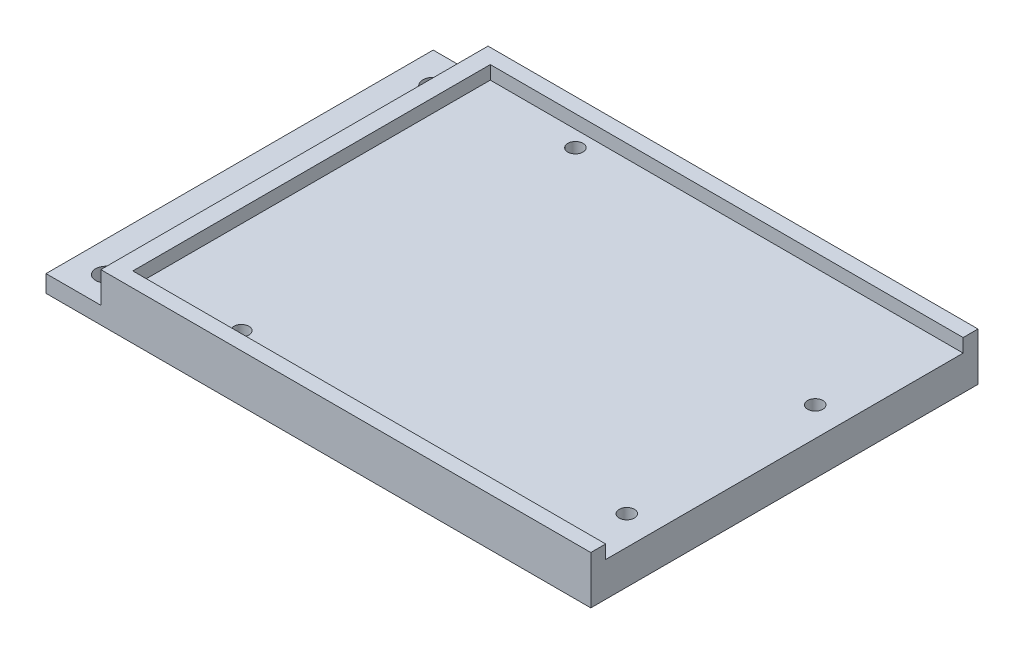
ISO-10303-21;
HEADER;
FILE_DESCRIPTION(('STEP AP214'),'2;1');
FILE_NAME('part.step','',(''),(''),'','','');
FILE_SCHEMA(('AUTOMOTIVE_DESIGN { 1 0 10303 214 1 1 1 1 }'));
ENDSEC;
DATA;
#1=APPLICATION_CONTEXT('core data for automotive mechanical design processes');
#2=APPLICATION_PROTOCOL_DEFINITION('international standard','automotive_design',2000,#1);
#3=PRODUCT_CONTEXT('',#1,'mechanical');
#4=PRODUCT('Part','Part','',(#3));
#5=PRODUCT_RELATED_PRODUCT_CATEGORY('part','',(#4));
#6=PRODUCT_DEFINITION_FORMATION('','',#4);
#7=PRODUCT_DEFINITION_CONTEXT('part definition',#1,'design');
#8=PRODUCT_DEFINITION('design','',#6,#7);
#9=PRODUCT_DEFINITION_SHAPE('','',#8);
#10=(LENGTH_UNIT() NAMED_UNIT(*) SI_UNIT(.MILLI.,.METRE.));
#11=(NAMED_UNIT(*) PLANE_ANGLE_UNIT() SI_UNIT($,.RADIAN.));
#12=(NAMED_UNIT(*) SI_UNIT($,.STERADIAN.) SOLID_ANGLE_UNIT());
#13=UNCERTAINTY_MEASURE_WITH_UNIT(LENGTH_MEASURE(1.E-05),#10,'distance_accuracy_value','');
#14=(GEOMETRIC_REPRESENTATION_CONTEXT(3) GLOBAL_UNCERTAINTY_ASSIGNED_CONTEXT((#13)) GLOBAL_UNIT_ASSIGNED_CONTEXT((#10,
#11,#12)) REPRESENTATION_CONTEXT('',''));
#15=CARTESIAN_POINT('',(0.,0.,0.));
#16=DIRECTION('',(0.,0.,1.));
#17=DIRECTION('',(1.,0.,0.));
#18=AXIS2_PLACEMENT_3D('',#15,#16,#17);
#19=CARTESIAN_POINT('',(-16.002,0.,24.13));
#20=DIRECTION('',(0.,1.,0.));
#21=DIRECTION('',(0.,0.,1.));
#22=AXIS2_PLACEMENT_3D('',#19,#20,#21);
#23=CYLINDRICAL_SURFACE('',#22,1.1303);
#24=CARTESIAN_POINT('',(-16.002,0.,24.13));
#25=DIRECTION('',(0.,1.,0.));
#26=DIRECTION('',(0.,0.,1.));
#27=AXIS2_PLACEMENT_3D('',#24,#25,#26);
#28=CIRCLE('',#27,1.1303);
#29=CARTESIAN_POINT('',(-16.002,0.,25.2603));
#30=VERTEX_POINT('',#29);
#31=EDGE_CURVE('E167',#30,#30,#28,.T.);
#32=ORIENTED_EDGE('',*,*,#31,.F.);
#33=EDGE_LOOP('',(#32));
#34=FACE_BOUND('',#33,.T.);
#35=CARTESIAN_POINT('',(-16.002,5.112,24.13));
#36=DIRECTION('',(0.,1.,0.));
#37=DIRECTION('',(0.,0.,1.));
#38=AXIS2_PLACEMENT_3D('',#35,#36,#37);
#39=CIRCLE('',#38,1.1303);
#40=CARTESIAN_POINT('',(-16.002,5.112,25.2603));
#41=VERTEX_POINT('',#40);
#42=EDGE_CURVE('E153',#41,#41,#39,.F.);
#43=ORIENTED_EDGE('',*,*,#42,.F.);
#44=EDGE_LOOP('',(#43));
#45=FACE_BOUND('',#44,.T.);
#46=ADVANCED_FACE('F32',(#34,#45),#23,.F.);
#47=CARTESIAN_POINT('',(36.068,0.,-8.89000000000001));
#48=DIRECTION('',(0.,1.,0.));
#49=DIRECTION('',(0.,0.,1.));
#50=AXIS2_PLACEMENT_3D('',#47,#48,#49);
#51=CYLINDRICAL_SURFACE('',#50,1.13029999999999);
#52=CARTESIAN_POINT('',(36.068,0.,-8.89000000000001));
#53=DIRECTION('',(0.,1.,0.));
#54=DIRECTION('',(0.,0.,1.));
#55=AXIS2_PLACEMENT_3D('',#52,#53,#54);
#56=CIRCLE('',#55,1.13029999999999);
#57=CARTESIAN_POINT('',(36.068,0.,-7.75970000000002));
#58=VERTEX_POINT('',#57);
#59=EDGE_CURVE('E171',#58,#58,#56,.T.);
#60=ORIENTED_EDGE('',*,*,#59,.F.);
#61=EDGE_LOOP('',(#60));
#62=FACE_BOUND('',#61,.T.);
#63=CARTESIAN_POINT('',(36.068,5.112,-8.89000000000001));
#64=DIRECTION('',(0.,1.,0.));
#65=DIRECTION('',(0.,0.,1.));
#66=AXIS2_PLACEMENT_3D('',#63,#64,#65);
#67=CIRCLE('',#66,1.13029999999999);
#68=CARTESIAN_POINT('',(36.068,5.112,-7.75970000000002));
#69=VERTEX_POINT('',#68);
#70=EDGE_CURVE('E150',#69,#69,#67,.F.);
#71=ORIENTED_EDGE('',*,*,#70,.F.);
#72=EDGE_LOOP('',(#71));
#73=FACE_BOUND('',#72,.T.);
#74=ADVANCED_FACE('F241',(#62,#73),#51,.F.);
#75=CARTESIAN_POINT('',(36.068,0.,19.05));
#76=DIRECTION('',(0.,1.,0.));
#77=DIRECTION('',(0.,0.,1.));
#78=AXIS2_PLACEMENT_3D('',#75,#76,#77);
#79=CYLINDRICAL_SURFACE('',#78,1.1303);
#80=CARTESIAN_POINT('',(36.068,0.,19.05));
#81=DIRECTION('',(0.,1.,0.));
#82=DIRECTION('',(0.,0.,1.));
#83=AXIS2_PLACEMENT_3D('',#80,#81,#82);
#84=CIRCLE('',#83,1.1303);
#85=CARTESIAN_POINT('',(36.068,0.,20.1803));
#86=VERTEX_POINT('',#85);
#87=EDGE_CURVE('E168',#86,#86,#84,.T.);
#88=ORIENTED_EDGE('',*,*,#87,.F.);
#89=EDGE_LOOP('',(#88));
#90=FACE_BOUND('',#89,.T.);
#91=CARTESIAN_POINT('',(36.068,5.112,19.05));
#92=DIRECTION('',(0.,1.,0.));
#93=DIRECTION('',(0.,0.,1.));
#94=AXIS2_PLACEMENT_3D('',#91,#92,#93);
#95=CIRCLE('',#94,1.1303);
#96=CARTESIAN_POINT('',(36.068,5.112,20.1803));
#97=VERTEX_POINT('',#96);
#98=EDGE_CURVE('E147',#97,#97,#95,.F.);
#99=ORIENTED_EDGE('',*,*,#98,.F.);
#100=EDGE_LOOP('',(#99));
#101=FACE_BOUND('',#100,.T.);
#102=ADVANCED_FACE('F248',(#90,#101),#79,.F.);
#103=CARTESIAN_POINT('',(-14.732,0.,-24.13));
#104=DIRECTION('',(0.,1.,0.));
#105=DIRECTION('',(0.,0.,1.));
#106=AXIS2_PLACEMENT_3D('',#103,#104,#105);
#107=CYLINDRICAL_SURFACE('',#106,1.1303);
#108=CARTESIAN_POINT('',(-14.732,0.,-24.13));
#109=DIRECTION('',(0.,1.,0.));
#110=DIRECTION('',(0.,0.,1.));
#111=AXIS2_PLACEMENT_3D('',#108,#109,#110);
#112=CIRCLE('',#111,1.1303);
#113=CARTESIAN_POINT('',(-14.732,0.,-22.9997));
#114=VERTEX_POINT('',#113);
#115=EDGE_CURVE('E163',#114,#114,#112,.T.);
#116=ORIENTED_EDGE('',*,*,#115,.F.);
#117=EDGE_LOOP('',(#116));
#118=FACE_BOUND('',#117,.T.);
#119=CARTESIAN_POINT('',(-14.732,5.112,-24.13));
#120=DIRECTION('',(0.,1.,0.));
#121=DIRECTION('',(0.,0.,1.));
#122=AXIS2_PLACEMENT_3D('',#119,#120,#121);
#123=CIRCLE('',#122,1.1303);
#124=CARTESIAN_POINT('',(-14.732,5.112,-22.9997));
#125=VERTEX_POINT('',#124);
#126=EDGE_CURVE('E36',#125,#125,#123,.F.);
#127=ORIENTED_EDGE('',*,*,#126,.F.);
#128=EDGE_LOOP('',(#127));
#129=FACE_BOUND('',#128,.T.);
#130=ADVANCED_FACE('F281',(#118,#129),#107,.F.);
#131=CARTESIAN_POINT('',(40.386,7.112,-28.702));
#132=DIRECTION('',(-1.,0.,0.));
#133=DIRECTION('',(0.,0.,1.));
#134=AXIS2_PLACEMENT_3D('',#131,#132,#133);
#135=PLANE('',#134);
#136=DIRECTION('',(0.,0.,-1.));
#137=VECTOR('',#136,1.);
#138=CARTESIAN_POINT('',(40.386,7.112,-28.702));
#139=LINE('',#138,#137);
#140=CARTESIAN_POINT('',(40.386,7.112,-26.499999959));
#141=VERTEX_POINT('',#140);
#142=CARTESIAN_POINT('',(40.386,7.112,-28.702));
#143=VERTEX_POINT('',#142);
#144=EDGE_CURVE('E194',#141,#143,#139,.T.);
#145=ORIENTED_EDGE('',*,*,#144,.F.);
#146=DIRECTION('',(0.,1.,0.));
#147=VECTOR('',#146,1.);
#148=CARTESIAN_POINT('',(40.386,5.112,-26.499999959));
#149=LINE('',#148,#147);
#150=CARTESIAN_POINT('',(40.386,5.112,-26.499999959));
#151=VERTEX_POINT('',#150);
#152=EDGE_CURVE('E144',#151,#141,#149,.T.);
#153=ORIENTED_EDGE('',*,*,#152,.F.);
#154=DIRECTION('',(0.,0.,-1.));
#155=VECTOR('',#154,1.);
#156=CARTESIAN_POINT('',(40.386,5.112,-26.499999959));
#157=LINE('',#156,#155);
#158=CARTESIAN_POINT('',(40.386,5.112,26.499999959));
#159=VERTEX_POINT('',#158);
#160=EDGE_CURVE('E127',#159,#151,#157,.T.);
#161=ORIENTED_EDGE('',*,*,#160,.F.);
#162=DIRECTION('',(0.,1.,0.));
#163=VECTOR('',#162,1.);
#164=CARTESIAN_POINT('',(40.386,5.112,26.499999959));
#165=LINE('',#164,#163);
#166=CARTESIAN_POINT('',(40.386,7.112,26.499999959));
#167=VERTEX_POINT('',#166);
#168=EDGE_CURVE('E118',#159,#167,#165,.T.);
#169=ORIENTED_EDGE('',*,*,#168,.T.);
#170=CARTESIAN_POINT('',(40.386,7.112,28.702));
#171=VERTEX_POINT('',#170);
#172=EDGE_CURVE('E190',#171,#167,#139,.T.);
#173=ORIENTED_EDGE('',*,*,#172,.F.);
#174=DIRECTION('',(0.,-1.,0.));
#175=VECTOR('',#174,1.);
#176=CARTESIAN_POINT('',(40.386,7.112,28.702));
#177=LINE('',#176,#175);
#178=CARTESIAN_POINT('',(40.386,0.,28.702));
#179=VERTEX_POINT('',#178);
#180=EDGE_CURVE('E199',#171,#179,#177,.T.);
#181=ORIENTED_EDGE('',*,*,#180,.T.);
#182=DIRECTION('',(0.,0.,-1.));
#183=VECTOR('',#182,1.);
#184=CARTESIAN_POINT('',(40.386,0.,-28.702));
#185=LINE('',#184,#183);
#186=CARTESIAN_POINT('',(40.386,0.,-28.702));
#187=VERTEX_POINT('',#186);
#188=EDGE_CURVE('E189',#179,#187,#185,.T.);
#189=ORIENTED_EDGE('',*,*,#188,.T.);
#190=DIRECTION('',(0.,-1.,0.));
#191=VECTOR('',#190,1.);
#192=CARTESIAN_POINT('',(40.386,7.112,-28.702));
#193=LINE('',#192,#191);
#194=EDGE_CURVE('E41',#143,#187,#193,.T.);
#195=ORIENTED_EDGE('',*,*,#194,.F.);
#196=EDGE_LOOP('',(#145,#153,#161,#169,#173,#181,#189,#195));
#197=FACE_BOUND('',#196,.T.);
#198=ADVANCED_FACE('F34',(#197),#135,.F.);
#199=CARTESIAN_POINT('',(-40.386,7.112,-28.702));
#200=DIRECTION('',(0.,0.,1.));
#201=DIRECTION('',(1.,0.,0.));
#202=AXIS2_PLACEMENT_3D('',#199,#200,#201);
#203=PLANE('',#202);
#204=DIRECTION('',(1.,0.,0.));
#205=VECTOR('',#204,1.);
#206=CARTESIAN_POINT('',(-40.386,2.54,-28.702));
#207=LINE('',#206,#205);
#208=CARTESIAN_POINT('',(-40.386,2.54,-28.702));
#209=VERTEX_POINT('',#208);
#210=CARTESIAN_POINT('',(-32.258,2.54,-28.702));
#211=VERTEX_POINT('',#210);
#212=EDGE_CURVE('E166',#209,#211,#207,.T.);
#213=ORIENTED_EDGE('',*,*,#212,.T.);
#214=DIRECTION('',(0.,1.,0.));
#215=VECTOR('',#214,1.);
#216=CARTESIAN_POINT('',(-32.258,2.54,-28.702));
#217=LINE('',#216,#215);
#218=CARTESIAN_POINT('',(-32.258,7.112,-28.702));
#219=VERTEX_POINT('',#218);
#220=EDGE_CURVE('E179',#211,#219,#217,.T.);
#221=ORIENTED_EDGE('',*,*,#220,.T.);
#222=DIRECTION('',(-1.,0.,0.));
#223=VECTOR('',#222,1.);
#224=CARTESIAN_POINT('',(-40.386,7.112,-28.702));
#225=LINE('',#224,#223);
#226=EDGE_CURVE('E193',#143,#219,#225,.T.);
#227=ORIENTED_EDGE('',*,*,#226,.F.);
#228=ORIENTED_EDGE('',*,*,#194,.T.);
#229=DIRECTION('',(-1.,0.,0.));
#230=VECTOR('',#229,1.);
#231=CARTESIAN_POINT('',(-40.386,0.,-28.702));
#232=LINE('',#231,#230);
#233=CARTESIAN_POINT('',(-40.386,0.,-28.702));
#234=VERTEX_POINT('',#233);
#235=EDGE_CURVE('E202',#187,#234,#232,.T.);
#236=ORIENTED_EDGE('',*,*,#235,.T.);
#237=DIRECTION('',(0.,-1.,0.));
#238=VECTOR('',#237,1.);
#239=CARTESIAN_POINT('',(-40.386,7.112,-28.702));
#240=LINE('',#239,#238);
#241=EDGE_CURVE('E214',#209,#234,#240,.T.);
#242=ORIENTED_EDGE('',*,*,#241,.F.);
#243=EDGE_LOOP('',(#213,#221,#227,#228,#236,#242));
#244=FACE_BOUND('',#243,.T.);
#245=ADVANCED_FACE('F274',(#244),#203,.F.);
#246=CARTESIAN_POINT('',(-40.386,7.112,-28.702));
#247=DIRECTION('',(1.,0.,0.));
#248=DIRECTION('',(0.,0.,-1.));
#249=AXIS2_PLACEMENT_3D('',#246,#247,#248);
#250=PLANE('',#249);
#251=DIRECTION('',(0.,-1.,0.));
#252=VECTOR('',#251,1.);
#253=CARTESIAN_POINT('',(-40.386,7.112,28.702));
#254=LINE('',#253,#252);
#255=CARTESIAN_POINT('',(-40.386,2.54,28.702));
#256=VERTEX_POINT('',#255);
#257=CARTESIAN_POINT('',(-40.386,0.,28.702));
#258=VERTEX_POINT('',#257);
#259=EDGE_CURVE('E212',#256,#258,#254,.T.);
#260=ORIENTED_EDGE('',*,*,#259,.F.);
#261=DIRECTION('',(0.,0.,1.));
#262=VECTOR('',#261,1.);
#263=CARTESIAN_POINT('',(-40.386,2.54,-28.702));
#264=LINE('',#263,#262);
#265=EDGE_CURVE('E182',#209,#256,#264,.T.);
#266=ORIENTED_EDGE('',*,*,#265,.F.);
#267=ORIENTED_EDGE('',*,*,#241,.T.);
#268=DIRECTION('',(0.,0.,1.));
#269=VECTOR('',#268,1.);
#270=CARTESIAN_POINT('',(-40.386,0.,-28.702));
#271=LINE('',#270,#269);
#272=EDGE_CURVE('E205',#234,#258,#271,.T.);
#273=ORIENTED_EDGE('',*,*,#272,.T.);
#274=EDGE_LOOP('',(#260,#266,#267,#273));
#275=FACE_BOUND('',#274,.T.);
#276=ADVANCED_FACE('F271',(#275),#250,.F.);
#277=CARTESIAN_POINT('',(-40.386,7.112,28.702));
#278=DIRECTION('',(0.,0.,-1.));
#279=DIRECTION('',(-1.,0.,0.));
#280=AXIS2_PLACEMENT_3D('',#277,#278,#279);
#281=PLANE('',#280);
#282=DIRECTION('',(1.,0.,0.));
#283=VECTOR('',#282,1.);
#284=CARTESIAN_POINT('',(-40.386,7.112,28.702));
#285=LINE('',#284,#283);
#286=CARTESIAN_POINT('',(-32.258,7.112,28.702));
#287=VERTEX_POINT('',#286);
#288=EDGE_CURVE('E197',#287,#171,#285,.T.);
#289=ORIENTED_EDGE('',*,*,#288,.F.);
#290=DIRECTION('',(0.,-1.,0.));
#291=VECTOR('',#290,1.);
#292=CARTESIAN_POINT('',(-32.258,7.112,28.702));
#293=LINE('',#292,#291);
#294=CARTESIAN_POINT('',(-32.258,2.54,28.702));
#295=VERTEX_POINT('',#294);
#296=EDGE_CURVE('E57',#287,#295,#293,.T.);
#297=ORIENTED_EDGE('',*,*,#296,.T.);
#298=DIRECTION('',(-1.,0.,0.));
#299=VECTOR('',#298,1.);
#300=CARTESIAN_POINT('',(-40.386,2.54,28.702));
#301=LINE('',#300,#299);
#302=EDGE_CURVE('E11',#295,#256,#301,.T.);
#303=ORIENTED_EDGE('',*,*,#302,.T.);
#304=ORIENTED_EDGE('',*,*,#259,.T.);
#305=DIRECTION('',(1.,0.,0.));
#306=VECTOR('',#305,1.);
#307=CARTESIAN_POINT('',(-40.386,0.,28.702));
#308=LINE('',#307,#306);
#309=EDGE_CURVE('E208',#258,#179,#308,.T.);
#310=ORIENTED_EDGE('',*,*,#309,.T.);
#311=ORIENTED_EDGE('',*,*,#180,.F.);
#312=EDGE_LOOP('',(#289,#297,#303,#304,#310,#311));
#313=FACE_BOUND('',#312,.T.);
#314=ADVANCED_FACE('F264',(#313),#281,.F.);
#315=CARTESIAN_POINT('',(0.,7.112,0.));
#316=DIRECTION('',(0.,1.,0.));
#317=DIRECTION('',(0.,0.,1.));
#318=AXIS2_PLACEMENT_3D('',#315,#316,#317);
#319=PLANE('',#318);
#320=DIRECTION('',(-1.,0.,0.));
#321=VECTOR('',#320,1.);
#322=CARTESIAN_POINT('',(-29.718,7.112,-26.499999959));
#323=LINE('',#322,#321);
#324=CARTESIAN_POINT('',(-29.718,7.112,-26.499999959));
#325=VERTEX_POINT('',#324);
#326=EDGE_CURVE('E132',#141,#325,#323,.T.);
#327=ORIENTED_EDGE('',*,*,#326,.F.);
#328=ORIENTED_EDGE('',*,*,#144,.T.);
#329=ORIENTED_EDGE('',*,*,#226,.T.);
#330=DIRECTION('',(0.,0.,1.));
#331=VECTOR('',#330,1.);
#332=CARTESIAN_POINT('',(-32.258,7.112,-28.702));
#333=LINE('',#332,#331);
#334=EDGE_CURVE('E183',#219,#287,#333,.T.);
#335=ORIENTED_EDGE('',*,*,#334,.T.);
#336=ORIENTED_EDGE('',*,*,#288,.T.);
#337=ORIENTED_EDGE('',*,*,#172,.T.);
#338=DIRECTION('',(1.,0.,0.));
#339=VECTOR('',#338,1.);
#340=CARTESIAN_POINT('',(-29.718,7.112,26.499999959));
#341=LINE('',#340,#339);
#342=CARTESIAN_POINT('',(-29.718,7.112,26.499999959));
#343=VERTEX_POINT('',#342);
#344=EDGE_CURVE('E135',#343,#167,#341,.T.);
#345=ORIENTED_EDGE('',*,*,#344,.F.);
#346=DIRECTION('',(0.,0.,1.));
#347=VECTOR('',#346,1.);
#348=CARTESIAN_POINT('',(-29.718,7.112,-26.499999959));
#349=LINE('',#348,#347);
#350=EDGE_CURVE('E49',#325,#343,#349,.T.);
#351=ORIENTED_EDGE('',*,*,#350,.F.);
#352=EDGE_LOOP('',(#327,#328,#329,#335,#336,#337,#345,#351));
#353=FACE_BOUND('',#352,.T.);
#354=ADVANCED_FACE('F261',(#353),#319,.T.);
#355=CARTESIAN_POINT('',(0.,0.,0.));
#356=DIRECTION('',(0.,1.,0.));
#357=DIRECTION('',(0.,0.,1.));
#358=AXIS2_PLACEMENT_3D('',#355,#356,#357);
#359=PLANE('',#358);
#360=CARTESIAN_POINT('',(-35.814,0.,24.384));
#361=DIRECTION('',(0.,1.,0.));
#362=DIRECTION('',(-1.,0.,0.));
#363=AXIS2_PLACEMENT_3D('',#360,#361,#362);
#364=CIRCLE('',#363,1.524);
#365=CARTESIAN_POINT('',(-37.338,0.,24.384));
#366=VERTEX_POINT('',#365);
#367=EDGE_CURVE('E157',#366,#366,#364,.T.);
#368=ORIENTED_EDGE('',*,*,#367,.T.);
#369=EDGE_LOOP('',(#368));
#370=FACE_BOUND('',#369,.T.);
#371=CARTESIAN_POINT('',(-35.814,0.,-24.13));
#372=DIRECTION('',(0.,1.,0.));
#373=DIRECTION('',(-1.,0.,0.));
#374=AXIS2_PLACEMENT_3D('',#371,#372,#373);
#375=CIRCLE('',#374,1.524);
#376=CARTESIAN_POINT('',(-37.338,0.,-24.13));
#377=VERTEX_POINT('',#376);
#378=EDGE_CURVE('E156',#377,#377,#375,.T.);
#379=ORIENTED_EDGE('',*,*,#378,.T.);
#380=EDGE_LOOP('',(#379));
#381=FACE_BOUND('',#380,.T.);
#382=ORIENTED_EDGE('',*,*,#115,.T.);
#383=EDGE_LOOP('',(#382));
#384=FACE_BOUND('',#383,.T.);
#385=ORIENTED_EDGE('',*,*,#87,.T.);
#386=EDGE_LOOP('',(#385));
#387=FACE_BOUND('',#386,.T.);
#388=ORIENTED_EDGE('',*,*,#59,.T.);
#389=EDGE_LOOP('',(#388));
#390=FACE_BOUND('',#389,.T.);
#391=ORIENTED_EDGE('',*,*,#31,.T.);
#392=EDGE_LOOP('',(#391));
#393=FACE_BOUND('',#392,.T.);
#394=ORIENTED_EDGE('',*,*,#188,.F.);
#395=ORIENTED_EDGE('',*,*,#309,.F.);
#396=ORIENTED_EDGE('',*,*,#272,.F.);
#397=ORIENTED_EDGE('',*,*,#235,.F.);
#398=EDGE_LOOP('',(#394,#395,#396,#397));
#399=FACE_BOUND('',#398,.T.);
#400=ADVANCED_FACE('F260',(#370,#381,#384,#387,#390,#393,#399),#359,.F.);
#401=CARTESIAN_POINT('',(-40.386,2.54,-28.702));
#402=DIRECTION('',(0.,-1.,0.));
#403=DIRECTION('',(1.,0.,0.));
#404=AXIS2_PLACEMENT_3D('',#401,#402,#403);
#405=PLANE('',#404);
#406=CARTESIAN_POINT('',(-35.814,2.54,24.384));
#407=DIRECTION('',(0.,-1.,0.));
#408=DIRECTION('',(1.,0.,0.));
#409=AXIS2_PLACEMENT_3D('',#406,#407,#408);
#410=CIRCLE('',#409,1.524);
#411=CARTESIAN_POINT('',(-34.29,2.54,24.384));
#412=VERTEX_POINT('',#411);
#413=EDGE_CURVE('E172',#412,#412,#410,.T.);
#414=ORIENTED_EDGE('',*,*,#413,.T.);
#415=EDGE_LOOP('',(#414));
#416=FACE_BOUND('',#415,.T.);
#417=CARTESIAN_POINT('',(-35.814,2.54,-24.13));
#418=DIRECTION('',(0.,-1.,0.));
#419=DIRECTION('',(1.,0.,0.));
#420=AXIS2_PLACEMENT_3D('',#417,#418,#419);
#421=CIRCLE('',#420,1.524);
#422=CARTESIAN_POINT('',(-34.29,2.54,-24.13));
#423=VERTEX_POINT('',#422);
#424=EDGE_CURVE('E160',#423,#423,#421,.T.);
#425=ORIENTED_EDGE('',*,*,#424,.T.);
#426=EDGE_LOOP('',(#425));
#427=FACE_BOUND('',#426,.T.);
#428=DIRECTION('',(0.,0.,1.));
#429=VECTOR('',#428,1.);
#430=CARTESIAN_POINT('',(-32.258,2.54,-28.702));
#431=LINE('',#430,#429);
#432=EDGE_CURVE('E185',#211,#295,#431,.T.);
#433=ORIENTED_EDGE('',*,*,#432,.F.);
#434=ORIENTED_EDGE('',*,*,#212,.F.);
#435=ORIENTED_EDGE('',*,*,#265,.T.);
#436=ORIENTED_EDGE('',*,*,#302,.F.);
#437=EDGE_LOOP('',(#433,#434,#435,#436));
#438=FACE_BOUND('',#437,.T.);
#439=ADVANCED_FACE('F222',(#416,#427,#438),#405,.F.);
#440=CARTESIAN_POINT('',(-32.258,2.54,-28.702));
#441=DIRECTION('',(1.,0.,0.));
#442=DIRECTION('',(0.,0.,-1.));
#443=AXIS2_PLACEMENT_3D('',#440,#441,#442);
#444=PLANE('',#443);
#445=ORIENTED_EDGE('',*,*,#334,.F.);
#446=ORIENTED_EDGE('',*,*,#220,.F.);
#447=ORIENTED_EDGE('',*,*,#432,.T.);
#448=ORIENTED_EDGE('',*,*,#296,.F.);
#449=EDGE_LOOP('',(#445,#446,#447,#448));
#450=FACE_BOUND('',#449,.T.);
#451=ADVANCED_FACE('F235',(#450),#444,.F.);
#452=CARTESIAN_POINT('',(-35.814,0.,-24.13));
#453=DIRECTION('',(0.,1.,0.));
#454=DIRECTION('',(-1.,0.,0.));
#455=AXIS2_PLACEMENT_3D('',#452,#453,#454);
#456=CYLINDRICAL_SURFACE('',#455,1.524);
#457=ORIENTED_EDGE('',*,*,#378,.F.);
#458=EDGE_LOOP('',(#457));
#459=FACE_BOUND('',#458,.T.);
#460=ORIENTED_EDGE('',*,*,#424,.F.);
#461=EDGE_LOOP('',(#460));
#462=FACE_BOUND('',#461,.T.);
#463=ADVANCED_FACE('F227',(#459,#462),#456,.F.);
#464=CARTESIAN_POINT('',(-35.814,0.,24.384));
#465=DIRECTION('',(0.,1.,0.));
#466=DIRECTION('',(-1.,0.,0.));
#467=AXIS2_PLACEMENT_3D('',#464,#465,#466);
#468=CYLINDRICAL_SURFACE('',#467,1.524);
#469=ORIENTED_EDGE('',*,*,#367,.F.);
#470=EDGE_LOOP('',(#469));
#471=FACE_BOUND('',#470,.T.);
#472=ORIENTED_EDGE('',*,*,#413,.F.);
#473=EDGE_LOOP('',(#472));
#474=FACE_BOUND('',#473,.T.);
#475=ADVANCED_FACE('F225',(#471,#474),#468,.F.);
#476=CARTESIAN_POINT('',(0.,5.112,0.));
#477=DIRECTION('',(0.,1.,0.));
#478=DIRECTION('',(0.,0.,1.));
#479=AXIS2_PLACEMENT_3D('',#476,#477,#478);
#480=PLANE('',#479);
#481=DIRECTION('',(0.,0.,1.));
#482=VECTOR('',#481,1.);
#483=CARTESIAN_POINT('',(-29.718,5.112,-26.499999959));
#484=LINE('',#483,#482);
#485=CARTESIAN_POINT('',(-29.718,5.112,-26.499999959));
#486=VERTEX_POINT('',#485);
#487=CARTESIAN_POINT('',(-29.718,5.112,26.499999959));
#488=VERTEX_POINT('',#487);
#489=EDGE_CURVE('E114',#486,#488,#484,.T.);
#490=ORIENTED_EDGE('',*,*,#489,.T.);
#491=DIRECTION('',(1.,0.,0.));
#492=VECTOR('',#491,1.);
#493=CARTESIAN_POINT('',(-29.718,5.112,26.499999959));
#494=LINE('',#493,#492);
#495=EDGE_CURVE('E122',#488,#159,#494,.T.);
#496=ORIENTED_EDGE('',*,*,#495,.T.);
#497=ORIENTED_EDGE('',*,*,#160,.T.);
#498=DIRECTION('',(-1.,0.,0.));
#499=VECTOR('',#498,1.);
#500=CARTESIAN_POINT('',(-29.718,5.112,-26.499999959));
#501=LINE('',#500,#499);
#502=EDGE_CURVE('E119',#151,#486,#501,.T.);
#503=ORIENTED_EDGE('',*,*,#502,.T.);
#504=EDGE_LOOP('',(#490,#496,#497,#503));
#505=FACE_BOUND('',#504,.T.);
#506=ORIENTED_EDGE('',*,*,#126,.T.);
#507=EDGE_LOOP('',(#506));
#508=FACE_BOUND('',#507,.T.);
#509=ORIENTED_EDGE('',*,*,#98,.T.);
#510=EDGE_LOOP('',(#509));
#511=FACE_BOUND('',#510,.T.);
#512=ORIENTED_EDGE('',*,*,#70,.T.);
#513=EDGE_LOOP('',(#512));
#514=FACE_BOUND('',#513,.T.);
#515=ORIENTED_EDGE('',*,*,#42,.T.);
#516=EDGE_LOOP('',(#515));
#517=FACE_BOUND('',#516,.T.);
#518=ADVANCED_FACE('F129',(#505,#508,#511,#514,#517),#480,.T.);
#519=CARTESIAN_POINT('',(-29.718,5.112,-26.499999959));
#520=DIRECTION('',(-1.,0.,0.));
#521=DIRECTION('',(0.,0.,1.));
#522=AXIS2_PLACEMENT_3D('',#519,#520,#521);
#523=PLANE('',#522);
#524=ORIENTED_EDGE('',*,*,#350,.T.);
#525=DIRECTION('',(0.,1.,0.));
#526=VECTOR('',#525,1.);
#527=CARTESIAN_POINT('',(-29.718,5.112,26.499999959));
#528=LINE('',#527,#526);
#529=EDGE_CURVE('E110',#488,#343,#528,.T.);
#530=ORIENTED_EDGE('',*,*,#529,.F.);
#531=ORIENTED_EDGE('',*,*,#489,.F.);
#532=DIRECTION('',(0.,1.,0.));
#533=VECTOR('',#532,1.);
#534=CARTESIAN_POINT('',(-29.718,5.112,-26.499999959));
#535=LINE('',#534,#533);
#536=EDGE_CURVE('E142',#486,#325,#535,.T.);
#537=ORIENTED_EDGE('',*,*,#536,.T.);
#538=EDGE_LOOP('',(#524,#530,#531,#537));
#539=FACE_BOUND('',#538,.T.);
#540=ADVANCED_FACE('F112',(#539),#523,.F.);
#541=CARTESIAN_POINT('',(-29.718,5.112,-26.499999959));
#542=DIRECTION('',(0.,0.,-1.));
#543=DIRECTION('',(-1.,0.,0.));
#544=AXIS2_PLACEMENT_3D('',#541,#542,#543);
#545=PLANE('',#544);
#546=ORIENTED_EDGE('',*,*,#326,.T.);
#547=ORIENTED_EDGE('',*,*,#536,.F.);
#548=ORIENTED_EDGE('',*,*,#502,.F.);
#549=ORIENTED_EDGE('',*,*,#152,.T.);
#550=EDGE_LOOP('',(#546,#547,#548,#549));
#551=FACE_BOUND('',#550,.T.);
#552=ADVANCED_FACE('F301',(#551),#545,.F.);
#553=CARTESIAN_POINT('',(-29.718,5.112,26.499999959));
#554=DIRECTION('',(0.,0.,1.));
#555=DIRECTION('',(1.,0.,0.));
#556=AXIS2_PLACEMENT_3D('',#553,#554,#555);
#557=PLANE('',#556);
#558=ORIENTED_EDGE('',*,*,#344,.T.);
#559=ORIENTED_EDGE('',*,*,#168,.F.);
#560=ORIENTED_EDGE('',*,*,#495,.F.);
#561=ORIENTED_EDGE('',*,*,#529,.T.);
#562=EDGE_LOOP('',(#558,#559,#560,#561));
#563=FACE_BOUND('',#562,.T.);
#564=ADVANCED_FACE('F123',(#563),#557,.F.);
#565=CLOSED_SHELL('',(#46,#74,#102,#130,#198,#245,#276,#314,#354,#400,#439,#451,#463,#475,#518,
#540,#552,#564));
#566=MANIFOLD_SOLID_BREP('B2',#565);
#567=ADVANCED_BREP_SHAPE_REPRESENTATION('',(#18,#566),#14);
#568=SHAPE_DEFINITION_REPRESENTATION(#9,#567);
ENDSEC;
END-ISO-10303-21;
